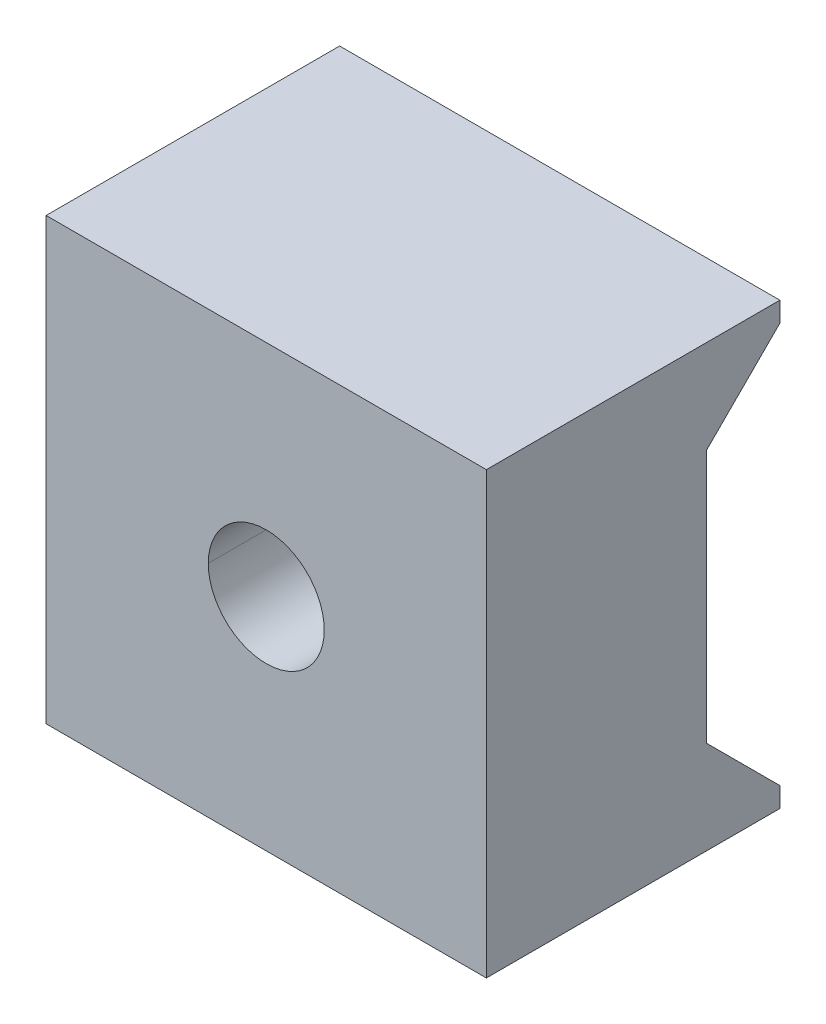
ISO-10303-21;
HEADER;
FILE_DESCRIPTION(('STEP AP214'),'2;1');
FILE_NAME('part.step','',(''),(''),'','','');
FILE_SCHEMA(('AUTOMOTIVE_DESIGN { 1 0 10303 214 1 1 1 1 }'));
ENDSEC;
DATA;
#1=APPLICATION_CONTEXT('core data for automotive mechanical design processes');
#2=APPLICATION_PROTOCOL_DEFINITION('international standard','automotive_design',2000,#1);
#3=PRODUCT_CONTEXT('',#1,'mechanical');
#4=PRODUCT('Part','Part','',(#3));
#5=PRODUCT_RELATED_PRODUCT_CATEGORY('part','',(#4));
#6=PRODUCT_DEFINITION_FORMATION('','',#4);
#7=PRODUCT_DEFINITION_CONTEXT('part definition',#1,'design');
#8=PRODUCT_DEFINITION('design','',#6,#7);
#9=PRODUCT_DEFINITION_SHAPE('','',#8);
#10=(LENGTH_UNIT() NAMED_UNIT(*) SI_UNIT(.MILLI.,.METRE.));
#11=(NAMED_UNIT(*) PLANE_ANGLE_UNIT() SI_UNIT($,.RADIAN.));
#12=(NAMED_UNIT(*) SI_UNIT($,.STERADIAN.) SOLID_ANGLE_UNIT());
#13=UNCERTAINTY_MEASURE_WITH_UNIT(LENGTH_MEASURE(1.E-05),#10,'distance_accuracy_value','');
#14=(GEOMETRIC_REPRESENTATION_CONTEXT(3) GLOBAL_UNCERTAINTY_ASSIGNED_CONTEXT((#13)) GLOBAL_UNIT_ASSIGNED_CONTEXT((#10,
#11,#12)) REPRESENTATION_CONTEXT('',''));
#15=CARTESIAN_POINT('',(0.,0.,0.));
#16=DIRECTION('',(0.,0.,1.));
#17=DIRECTION('',(1.,0.,0.));
#18=AXIS2_PLACEMENT_3D('',#15,#16,#17);
#19=CARTESIAN_POINT('',(38.1,-34.6526280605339,-25.4));
#20=DIRECTION('',(0.,0.707106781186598,-0.707106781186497));
#21=DIRECTION('',(0.,0.707106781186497,0.707106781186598));
#22=AXIS2_PLACEMENT_3D('',#19,#20,#21);
#23=PLANE('',#22);
#24=DIRECTION('',(0.,-0.707106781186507,-0.707106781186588));
#25=VECTOR('',#24,1.);
#26=CARTESIAN_POINT('',(38.1,-21.9526280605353,-12.7));
#27=LINE('',#26,#25);
#28=CARTESIAN_POINT('',(38.1,-21.9526280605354,-12.7));
#29=VERTEX_POINT('',#28);
#30=CARTESIAN_POINT('',(38.1,-34.6526280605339,-25.4));
#31=VERTEX_POINT('',#30);
#32=EDGE_CURVE('E135',#29,#31,#27,.T.);
#33=ORIENTED_EDGE('',*,*,#32,.T.);
#34=DIRECTION('',(1.,0.,0.));
#35=VECTOR('',#34,1.);
#36=CARTESIAN_POINT('',(38.1,-34.6526280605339,-25.4));
#37=LINE('',#36,#35);
#38=CARTESIAN_POINT('',(-38.1,-34.6526280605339,-25.4));
#39=VERTEX_POINT('',#38);
#40=EDGE_CURVE('E96',#39,#31,#37,.T.);
#41=ORIENTED_EDGE('',*,*,#40,.F.);
#42=DIRECTION('',(0.,0.707106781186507,0.707106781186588));
#43=VECTOR('',#42,1.);
#44=CARTESIAN_POINT('',(-38.1,-34.6526280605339,-25.4));
#45=LINE('',#44,#43);
#46=CARTESIAN_POINT('',(-38.1,-21.9526280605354,-12.6999999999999));
#47=VERTEX_POINT('',#46);
#48=EDGE_CURVE('E148',#39,#47,#45,.T.);
#49=ORIENTED_EDGE('',*,*,#48,.T.);
#50=DIRECTION('',(1.,0.,0.));
#51=VECTOR('',#50,1.);
#52=CARTESIAN_POINT('',(38.1,-21.9526280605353,-12.7));
#53=LINE('',#52,#51);
#54=EDGE_CURVE('E116',#29,#47,#53,.F.);
#55=ORIENTED_EDGE('',*,*,#54,.F.);
#56=EDGE_LOOP('',(#33,#41,#49,#55));
#57=FACE_BOUND('',#56,.T.);
#58=ADVANCED_FACE('F16',(#57),#23,.T.);
#59=CARTESIAN_POINT('',(38.1,-21.9526280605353,-12.7));
#60=DIRECTION('',(0.,0.,-1.));
#61=DIRECTION('',(0.,1.,0.));
#62=AXIS2_PLACEMENT_3D('',#59,#60,#61);
#63=PLANE('',#62);
#64=DIRECTION('',(0.,-1.,0.));
#65=VECTOR('',#64,1.);
#66=CARTESIAN_POINT('',(38.1,0.,-12.7));
#67=LINE('',#66,#65);
#68=CARTESIAN_POINT('',(38.1,21.9526280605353,-12.7));
#69=VERTEX_POINT('',#68);
#70=EDGE_CURVE('E132',#69,#29,#67,.T.);
#71=ORIENTED_EDGE('',*,*,#70,.T.);
#72=ORIENTED_EDGE('',*,*,#54,.T.);
#73=DIRECTION('',(0.,1.,0.));
#74=VECTOR('',#73,1.);
#75=CARTESIAN_POINT('',(-38.1,0.,-12.7));
#76=LINE('',#75,#74);
#77=CARTESIAN_POINT('',(-38.1,21.9526280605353,-12.7));
#78=VERTEX_POINT('',#77);
#79=EDGE_CURVE('E150',#47,#78,#76,.T.);
#80=ORIENTED_EDGE('',*,*,#79,.T.);
#81=DIRECTION('',(1.,0.,0.));
#82=VECTOR('',#81,1.);
#83=CARTESIAN_POINT('',(38.1,21.9526280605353,-12.7));
#84=LINE('',#83,#82);
#85=EDGE_CURVE('E119',#69,#78,#84,.F.);
#86=ORIENTED_EDGE('',*,*,#85,.F.);
#87=EDGE_LOOP('',(#71,#72,#80,#86));
#88=FACE_BOUND('',#87,.T.);
#89=CARTESIAN_POINT('',(0.,0.,-12.7));
#90=DIRECTION('',(0.,0.,1.));
#91=DIRECTION('',(1.,0.,0.));
#92=AXIS2_PLACEMENT_3D('',#89,#90,#91);
#93=CIRCLE('',#92,10.0330000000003);
#94=CARTESIAN_POINT('',(10.0330000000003,0.,-12.7));
#95=VERTEX_POINT('',#94);
#96=CARTESIAN_POINT('',(-10.0330000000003,0.,-12.7));
#97=VERTEX_POINT('',#96);
#98=EDGE_CURVE('E90',#95,#97,#93,.T.);
#99=ORIENTED_EDGE('',*,*,#98,.T.);
#100=CARTESIAN_POINT('',(0.,0.,-12.7));
#101=DIRECTION('',(0.,0.,1.));
#102=DIRECTION('',(1.,0.,0.));
#103=AXIS2_PLACEMENT_3D('',#100,#101,#102);
#104=CIRCLE('',#103,10.0330000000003);
#105=EDGE_CURVE('E19',#97,#95,#104,.T.);
#106=ORIENTED_EDGE('',*,*,#105,.T.);
#107=EDGE_LOOP('',(#99,#106));
#108=FACE_BOUND('',#107,.T.);
#109=ADVANCED_FACE('F93',(#88,#108),#63,.T.);
#110=CARTESIAN_POINT('',(38.1,21.9526280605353,-12.7));
#111=DIRECTION('',(0.,-0.707106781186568,-0.707106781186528));
#112=DIRECTION('',(0.,0.707106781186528,-0.707106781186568));
#113=AXIS2_PLACEMENT_3D('',#110,#111,#112);
#114=PLANE('',#113);
#115=DIRECTION('',(0.,-0.707106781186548,0.707106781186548));
#116=VECTOR('',#115,1.);
#117=CARTESIAN_POINT('',(38.1,34.6526280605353,-25.4));
#118=LINE('',#117,#116);
#119=CARTESIAN_POINT('',(38.1,34.6526280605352,-25.4000000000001));
#120=VERTEX_POINT('',#119);
#121=EDGE_CURVE('E129',#120,#69,#118,.T.);
#122=ORIENTED_EDGE('',*,*,#121,.T.);
#123=ORIENTED_EDGE('',*,*,#85,.T.);
#124=DIRECTION('',(0.,0.707106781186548,-0.707106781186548));
#125=VECTOR('',#124,1.);
#126=CARTESIAN_POINT('',(-38.1,21.9526280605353,-12.7));
#127=LINE('',#126,#125);
#128=CARTESIAN_POINT('',(-38.1,34.6526280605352,-25.4000000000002));
#129=VERTEX_POINT('',#128);
#130=EDGE_CURVE('E152',#78,#129,#127,.T.);
#131=ORIENTED_EDGE('',*,*,#130,.T.);
#132=DIRECTION('',(1.,0.,0.));
#133=VECTOR('',#132,1.);
#134=CARTESIAN_POINT('',(38.1,34.6526280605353,-25.4));
#135=LINE('',#134,#133);
#136=EDGE_CURVE('E122',#120,#129,#135,.F.);
#137=ORIENTED_EDGE('',*,*,#136,.F.);
#138=EDGE_LOOP('',(#122,#123,#131,#137));
#139=FACE_BOUND('',#138,.T.);
#140=ADVANCED_FACE('F185',(#139),#114,.T.);
#141=CARTESIAN_POINT('',(38.1,34.6526280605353,-25.4));
#142=DIRECTION('',(0.,0.,-1.));
#143=DIRECTION('',(0.,1.,0.));
#144=AXIS2_PLACEMENT_3D('',#141,#142,#143);
#145=PLANE('',#144);
#146=DIRECTION('',(0.,-1.,0.));
#147=VECTOR('',#146,1.);
#148=CARTESIAN_POINT('',(38.1,0.,-25.4));
#149=LINE('',#148,#147);
#150=CARTESIAN_POINT('',(38.1,38.1,-25.4));
#151=VERTEX_POINT('',#150);
#152=EDGE_CURVE('E105',#151,#120,#149,.T.);
#153=ORIENTED_EDGE('',*,*,#152,.T.);
#154=ORIENTED_EDGE('',*,*,#136,.T.);
#155=DIRECTION('',(0.,1.,0.));
#156=VECTOR('',#155,1.);
#157=CARTESIAN_POINT('',(-38.1,0.,-25.4));
#158=LINE('',#157,#156);
#159=CARTESIAN_POINT('',(-38.1,38.1,-25.4));
#160=VERTEX_POINT('',#159);
#161=EDGE_CURVE('E154',#129,#160,#158,.T.);
#162=ORIENTED_EDGE('',*,*,#161,.T.);
#163=DIRECTION('',(1.,0.,0.));
#164=VECTOR('',#163,1.);
#165=CARTESIAN_POINT('',(50.8,38.1,-25.4));
#166=LINE('',#165,#164);
#167=EDGE_CURVE('E142',#151,#160,#166,.F.);
#168=ORIENTED_EDGE('',*,*,#167,.F.);
#169=EDGE_LOOP('',(#153,#154,#162,#168));
#170=FACE_BOUND('',#169,.T.);
#171=ADVANCED_FACE('F182',(#170),#145,.T.);
#172=CARTESIAN_POINT('',(38.1,-38.1,-25.4));
#173=DIRECTION('',(0.,0.,-1.));
#174=DIRECTION('',(0.,1.,0.));
#175=AXIS2_PLACEMENT_3D('',#172,#173,#174);
#176=PLANE('',#175);
#177=DIRECTION('',(0.,-1.,0.));
#178=VECTOR('',#177,1.);
#179=CARTESIAN_POINT('',(38.1,0.,-25.4));
#180=LINE('',#179,#178);
#181=CARTESIAN_POINT('',(38.1,-38.1,-25.4));
#182=VERTEX_POINT('',#181);
#183=EDGE_CURVE('E137',#31,#182,#180,.T.);
#184=ORIENTED_EDGE('',*,*,#183,.T.);
#185=DIRECTION('',(1.,0.,0.));
#186=VECTOR('',#185,1.);
#187=CARTESIAN_POINT('',(-50.8,-38.1,-25.4));
#188=LINE('',#187,#186);
#189=CARTESIAN_POINT('',(-38.1,-38.1,-25.4));
#190=VERTEX_POINT('',#189);
#191=EDGE_CURVE('E159',#190,#182,#188,.T.);
#192=ORIENTED_EDGE('',*,*,#191,.F.);
#193=DIRECTION('',(0.,1.,0.));
#194=VECTOR('',#193,1.);
#195=CARTESIAN_POINT('',(-38.1,0.,-25.4));
#196=LINE('',#195,#194);
#197=EDGE_CURVE('E145',#190,#39,#196,.T.);
#198=ORIENTED_EDGE('',*,*,#197,.T.);
#199=ORIENTED_EDGE('',*,*,#40,.T.);
#200=EDGE_LOOP('',(#184,#192,#198,#199));
#201=FACE_BOUND('',#200,.T.);
#202=ADVANCED_FACE('F195',(#201),#176,.T.);
#203=CARTESIAN_POINT('',(0.,0.,6.35));
#204=DIRECTION('',(0.,0.,1.));
#205=DIRECTION('',(1.,0.,0.));
#206=AXIS2_PLACEMENT_3D('',#203,#204,#205);
#207=CYLINDRICAL_SURFACE('',#206,10.0330000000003);
#208=ORIENTED_EDGE('',*,*,#105,.F.);
#209=DIRECTION('',(0.,0.,1.));
#210=VECTOR('',#209,1.);
#211=CARTESIAN_POINT('',(-10.0330000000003,0.,6.35));
#212=LINE('',#211,#210);
#213=CARTESIAN_POINT('',(-10.0330000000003,0.,25.4));
#214=VERTEX_POINT('',#213);
#215=EDGE_CURVE('E106',#97,#214,#212,.T.);
#216=ORIENTED_EDGE('',*,*,#215,.T.);
#217=CARTESIAN_POINT('',(0.,0.,25.4));
#218=DIRECTION('',(0.,0.,1.));
#219=DIRECTION('',(1.,0.,0.));
#220=AXIS2_PLACEMENT_3D('',#217,#218,#219);
#221=CIRCLE('',#220,10.0330000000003);
#222=CARTESIAN_POINT('',(10.0330000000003,0.,25.4));
#223=VERTEX_POINT('',#222);
#224=EDGE_CURVE('E101',#223,#214,#221,.F.);
#225=ORIENTED_EDGE('',*,*,#224,.F.);
#226=DIRECTION('',(0.,0.,1.));
#227=VECTOR('',#226,1.);
#228=CARTESIAN_POINT('',(10.0330000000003,0.,6.35));
#229=LINE('',#228,#227);
#230=EDGE_CURVE('E98',#223,#95,#229,.F.);
#231=ORIENTED_EDGE('',*,*,#230,.T.);
#232=EDGE_LOOP('',(#208,#216,#225,#231));
#233=FACE_BOUND('',#232,.T.);
#234=ADVANCED_FACE('F99',(#233),#207,.F.);
#235=CARTESIAN_POINT('',(0.,0.,6.35));
#236=DIRECTION('',(0.,0.,1.));
#237=DIRECTION('',(1.,0.,0.));
#238=AXIS2_PLACEMENT_3D('',#235,#236,#237);
#239=CYLINDRICAL_SURFACE('',#238,10.0330000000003);
#240=CARTESIAN_POINT('',(0.,0.,25.4));
#241=DIRECTION('',(0.,0.,1.));
#242=DIRECTION('',(1.,0.,0.));
#243=AXIS2_PLACEMENT_3D('',#240,#241,#242);
#244=CIRCLE('',#243,10.0330000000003);
#245=EDGE_CURVE('E112',#214,#223,#244,.F.);
#246=ORIENTED_EDGE('',*,*,#245,.F.);
#247=ORIENTED_EDGE('',*,*,#215,.F.);
#248=ORIENTED_EDGE('',*,*,#98,.F.);
#249=ORIENTED_EDGE('',*,*,#230,.F.);
#250=EDGE_LOOP('',(#246,#247,#248,#249));
#251=FACE_BOUND('',#250,.T.);
#252=ADVANCED_FACE('F108',(#251),#239,.F.);
#253=CARTESIAN_POINT('',(38.1,0.,19.05));
#254=DIRECTION('',(-1.,0.,0.));
#255=DIRECTION('',(0.,-1.,0.));
#256=AXIS2_PLACEMENT_3D('',#253,#254,#255);
#257=PLANE('',#256);
#258=DIRECTION('',(0.,1.,0.));
#259=VECTOR('',#258,1.);
#260=CARTESIAN_POINT('',(38.1,0.,25.4));
#261=LINE('',#260,#259);
#262=CARTESIAN_POINT('',(38.1,-38.1,25.4));
#263=VERTEX_POINT('',#262);
#264=CARTESIAN_POINT('',(38.1,38.1,25.4));
#265=VERTEX_POINT('',#264);
#266=EDGE_CURVE('E115',#263,#265,#261,.T.);
#267=ORIENTED_EDGE('',*,*,#266,.F.);
#268=DIRECTION('',(0.,0.,-1.));
#269=VECTOR('',#268,1.);
#270=CARTESIAN_POINT('',(38.1,-38.1,1.08286712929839E-12));
#271=LINE('',#270,#269);
#272=EDGE_CURVE('E113',#182,#263,#271,.F.);
#273=ORIENTED_EDGE('',*,*,#272,.F.);
#274=ORIENTED_EDGE('',*,*,#183,.F.);
#275=ORIENTED_EDGE('',*,*,#32,.F.);
#276=ORIENTED_EDGE('',*,*,#70,.F.);
#277=ORIENTED_EDGE('',*,*,#121,.F.);
#278=ORIENTED_EDGE('',*,*,#152,.F.);
#279=DIRECTION('',(0.,0.,1.));
#280=VECTOR('',#279,1.);
#281=CARTESIAN_POINT('',(38.1,38.1,1.08286712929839E-12));
#282=LINE('',#281,#280);
#283=EDGE_CURVE('E139',#265,#151,#282,.F.);
#284=ORIENTED_EDGE('',*,*,#283,.F.);
#285=EDGE_LOOP('',(#267,#273,#274,#275,#276,#277,#278,#284));
#286=FACE_BOUND('',#285,.T.);
#287=ADVANCED_FACE('F200',(#286),#257,.F.);
#288=CARTESIAN_POINT('',(50.8,38.1,1.08286712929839E-12));
#289=DIRECTION('',(0.,1.,0.));
#290=DIRECTION('',(0.,0.,1.));
#291=AXIS2_PLACEMENT_3D('',#288,#289,#290);
#292=PLANE('',#291);
#293=ORIENTED_EDGE('',*,*,#283,.T.);
#294=ORIENTED_EDGE('',*,*,#167,.T.);
#295=DIRECTION('',(0.,0.,1.));
#296=VECTOR('',#295,1.);
#297=CARTESIAN_POINT('',(-38.1,38.1,19.05));
#298=LINE('',#297,#296);
#299=CARTESIAN_POINT('',(-38.1,38.1,25.4));
#300=VERTEX_POINT('',#299);
#301=EDGE_CURVE('E156',#160,#300,#298,.T.);
#302=ORIENTED_EDGE('',*,*,#301,.T.);
#303=DIRECTION('',(1.,0.,0.));
#304=VECTOR('',#303,1.);
#305=CARTESIAN_POINT('',(0.,38.1,25.4));
#306=LINE('',#305,#304);
#307=EDGE_CURVE('E166',#265,#300,#306,.F.);
#308=ORIENTED_EDGE('',*,*,#307,.F.);
#309=EDGE_LOOP('',(#293,#294,#302,#308));
#310=FACE_BOUND('',#309,.T.);
#311=ADVANCED_FACE('F179',(#310),#292,.T.);
#312=CARTESIAN_POINT('',(-38.1,0.,19.05));
#313=DIRECTION('',(1.,0.,0.));
#314=DIRECTION('',(0.,1.,0.));
#315=AXIS2_PLACEMENT_3D('',#312,#313,#314);
#316=PLANE('',#315);
#317=DIRECTION('',(0.,1.,0.));
#318=VECTOR('',#317,1.);
#319=CARTESIAN_POINT('',(-38.1,0.,25.4));
#320=LINE('',#319,#318);
#321=CARTESIAN_POINT('',(-38.1,-38.1,25.4));
#322=VERTEX_POINT('',#321);
#323=EDGE_CURVE('E25',#300,#322,#320,.F.);
#324=ORIENTED_EDGE('',*,*,#323,.F.);
#325=ORIENTED_EDGE('',*,*,#301,.F.);
#326=ORIENTED_EDGE('',*,*,#161,.F.);
#327=ORIENTED_EDGE('',*,*,#130,.F.);
#328=ORIENTED_EDGE('',*,*,#79,.F.);
#329=ORIENTED_EDGE('',*,*,#48,.F.);
#330=ORIENTED_EDGE('',*,*,#197,.F.);
#331=DIRECTION('',(0.,0.,-1.));
#332=VECTOR('',#331,1.);
#333=CARTESIAN_POINT('',(-38.1,-38.1,1.08286712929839E-12));
#334=LINE('',#333,#332);
#335=EDGE_CURVE('E34',#322,#190,#334,.T.);
#336=ORIENTED_EDGE('',*,*,#335,.F.);
#337=EDGE_LOOP('',(#324,#325,#326,#327,#328,#329,#330,#336));
#338=FACE_BOUND('',#337,.T.);
#339=ADVANCED_FACE('F175',(#338),#316,.F.);
#340=CARTESIAN_POINT('',(-50.8,-38.1,1.08286712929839E-12));
#341=DIRECTION('',(0.,-1.,0.));
#342=DIRECTION('',(0.,0.,-1.));
#343=AXIS2_PLACEMENT_3D('',#340,#341,#342);
#344=PLANE('',#343);
#345=ORIENTED_EDGE('',*,*,#272,.T.);
#346=DIRECTION('',(1.,0.,0.));
#347=VECTOR('',#346,1.);
#348=CARTESIAN_POINT('',(0.,-38.1,25.4));
#349=LINE('',#348,#347);
#350=EDGE_CURVE('E11',#322,#263,#349,.T.);
#351=ORIENTED_EDGE('',*,*,#350,.F.);
#352=ORIENTED_EDGE('',*,*,#335,.T.);
#353=ORIENTED_EDGE('',*,*,#191,.T.);
#354=EDGE_LOOP('',(#345,#351,#352,#353));
#355=FACE_BOUND('',#354,.T.);
#356=ADVANCED_FACE('F198',(#355),#344,.T.);
#357=CARTESIAN_POINT('',(0.,0.,25.4));
#358=DIRECTION('',(0.,0.,1.));
#359=DIRECTION('',(1.,0.,0.));
#360=AXIS2_PLACEMENT_3D('',#357,#358,#359);
#361=PLANE('',#360);
#362=ORIENTED_EDGE('',*,*,#323,.T.);
#363=ORIENTED_EDGE('',*,*,#350,.T.);
#364=ORIENTED_EDGE('',*,*,#266,.T.);
#365=ORIENTED_EDGE('',*,*,#307,.T.);
#366=EDGE_LOOP('',(#362,#363,#364,#365));
#367=FACE_BOUND('',#366,.T.);
#368=ORIENTED_EDGE('',*,*,#224,.T.);
#369=ORIENTED_EDGE('',*,*,#245,.T.);
#370=EDGE_LOOP('',(#368,#369));
#371=FACE_BOUND('',#370,.T.);
#372=ADVANCED_FACE('F171',(#367,#371),#361,.T.);
#373=CLOSED_SHELL('',(#58,#109,#140,#171,#202,#234,#252,#287,#311,#339,#356,#372));
#374=MANIFOLD_SOLID_BREP('B1',#373);
#375=ADVANCED_BREP_SHAPE_REPRESENTATION('',(#18,#374),#14);
#376=SHAPE_DEFINITION_REPRESENTATION(#9,#375);
ENDSEC;
END-ISO-10303-21;
